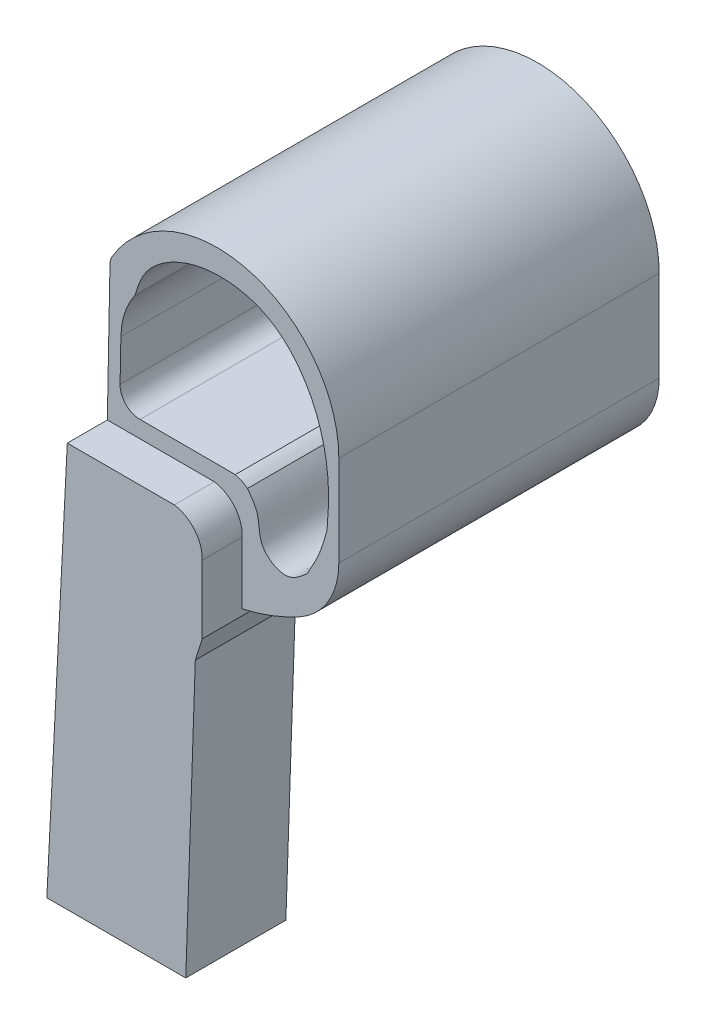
ISO-10303-21;
HEADER;
FILE_DESCRIPTION(('STEP AP214'),'2;1');
FILE_NAME('part.step','',(''),(''),'','','');
FILE_SCHEMA(('AUTOMOTIVE_DESIGN { 1 0 10303 214 1 1 1 1 }'));
ENDSEC;
DATA;
#1=APPLICATION_CONTEXT('core data for automotive mechanical design processes');
#2=APPLICATION_PROTOCOL_DEFINITION('international standard','automotive_design',2000,#1);
#3=PRODUCT_CONTEXT('',#1,'mechanical');
#4=PRODUCT('Part','Part','',(#3));
#5=PRODUCT_RELATED_PRODUCT_CATEGORY('part','',(#4));
#6=PRODUCT_DEFINITION_FORMATION('','',#4);
#7=PRODUCT_DEFINITION_CONTEXT('part definition',#1,'design');
#8=PRODUCT_DEFINITION('design','',#6,#7);
#9=PRODUCT_DEFINITION_SHAPE('','',#8);
#10=(LENGTH_UNIT() NAMED_UNIT(*) SI_UNIT(.MILLI.,.METRE.));
#11=(NAMED_UNIT(*) PLANE_ANGLE_UNIT() SI_UNIT($,.RADIAN.));
#12=(NAMED_UNIT(*) SI_UNIT($,.STERADIAN.) SOLID_ANGLE_UNIT());
#13=UNCERTAINTY_MEASURE_WITH_UNIT(LENGTH_MEASURE(1.E-05),#10,'distance_accuracy_value','');
#14=(GEOMETRIC_REPRESENTATION_CONTEXT(3) GLOBAL_UNCERTAINTY_ASSIGNED_CONTEXT((#13)) GLOBAL_UNIT_ASSIGNED_CONTEXT((#10,
#11,#12)) REPRESENTATION_CONTEXT('',''));
#15=CARTESIAN_POINT('',(0.,0.,0.));
#16=DIRECTION('',(0.,0.,1.));
#17=DIRECTION('',(1.,0.,0.));
#18=AXIS2_PLACEMENT_3D('',#15,#16,#17);
#19=CARTESIAN_POINT('',(-7.24053211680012,46.8617340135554,-65.));
#20=DIRECTION('',(0.,0.,1.));
#21=DIRECTION('',(1.,0.,0.));
#22=AXIS2_PLACEMENT_3D('',#19,#20,#21);
#23=CYLINDRICAL_SURFACE('',#22,6.73666835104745);
#24=DIRECTION('',(0.,0.,1.));
#25=VECTOR('',#24,1.);
#26=CARTESIAN_POINT('',(-8.77106708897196,53.4222342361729,-65.));
#27=LINE('',#26,#25);
#28=CARTESIAN_POINT('',(-8.77106708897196,53.4222342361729,-65.));
#29=VERTEX_POINT('',#28);
#30=CARTESIAN_POINT('',(-8.77106708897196,53.4222342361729,0.));
#31=VERTEX_POINT('',#30);
#32=EDGE_CURVE('E34',#29,#31,#27,.T.);
#33=ORIENTED_EDGE('',*,*,#32,.T.);
#34=CARTESIAN_POINT('',(-7.24053211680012,46.8617340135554,0.));
#35=DIRECTION('',(0.,0.,1.));
#36=DIRECTION('',(1.,0.,0.));
#37=AXIS2_PLACEMENT_3D('',#34,#35,#36);
#38=CIRCLE('',#37,6.73666835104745);
#39=CARTESIAN_POINT('',(-12.1966601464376,51.4245725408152,0.));
#40=VERTEX_POINT('',#39);
#41=EDGE_CURVE('E290',#31,#40,#38,.T.);
#42=ORIENTED_EDGE('',*,*,#41,.T.);
#43=DIRECTION('',(0.,0.,1.));
#44=VECTOR('',#43,1.);
#45=CARTESIAN_POINT('',(-12.1966601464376,51.4245725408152,-65.));
#46=LINE('',#45,#44);
#47=CARTESIAN_POINT('',(-12.1966601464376,51.4245725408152,-65.));
#48=VERTEX_POINT('',#47);
#49=EDGE_CURVE('E11',#48,#40,#46,.T.);
#50=ORIENTED_EDGE('',*,*,#49,.F.);
#51=CARTESIAN_POINT('',(-7.24053211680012,46.8617340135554,-65.));
#52=DIRECTION('',(0.,0.,-1.));
#53=DIRECTION('',(1.,0.,0.));
#54=AXIS2_PLACEMENT_3D('',#51,#52,#53);
#55=CIRCLE('',#54,6.73666835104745);
#56=EDGE_CURVE('E494',#48,#29,#55,.T.);
#57=ORIENTED_EDGE('',*,*,#56,.T.);
#58=EDGE_LOOP('',(#33,#42,#50,#57));
#59=FACE_BOUND('',#58,.T.);
#60=ADVANCED_FACE('F31',(#59),#23,.F.);
#61=CARTESIAN_POINT('',(-12.1966601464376,51.4245725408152,-65.));
#62=DIRECTION('',(0.,-1.,0.));
#63=DIRECTION('',(0.,0.,-1.));
#64=AXIS2_PLACEMENT_3D('',#61,#62,#63);
#65=PLANE('',#64);
#66=ORIENTED_EDGE('',*,*,#49,.T.);
#67=DIRECTION('',(-1.,0.,0.));
#68=VECTOR('',#67,1.);
#69=CARTESIAN_POINT('',(-12.1966601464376,51.4245725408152,0.));
#70=LINE('',#69,#68);
#71=CARTESIAN_POINT('',(-13.1539462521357,51.4245725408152,0.));
#72=VERTEX_POINT('',#71);
#73=EDGE_CURVE('E287',#40,#72,#70,.T.);
#74=ORIENTED_EDGE('',*,*,#73,.T.);
#75=DIRECTION('',(0.,0.,1.));
#76=VECTOR('',#75,1.);
#77=CARTESIAN_POINT('',(-13.1539462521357,51.4245725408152,-65.));
#78=LINE('',#77,#76);
#79=CARTESIAN_POINT('',(-13.1539462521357,51.4245725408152,-65.));
#80=VERTEX_POINT('',#79);
#81=EDGE_CURVE('E39',#80,#72,#78,.T.);
#82=ORIENTED_EDGE('',*,*,#81,.F.);
#83=DIRECTION('',(1.,0.,0.));
#84=VECTOR('',#83,1.);
#85=CARTESIAN_POINT('',(-12.1966601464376,51.4245725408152,-65.));
#86=LINE('',#85,#84);
#87=EDGE_CURVE('E499',#80,#48,#86,.T.);
#88=ORIENTED_EDGE('',*,*,#87,.T.);
#89=EDGE_LOOP('',(#66,#74,#82,#88));
#90=FACE_BOUND('',#89,.T.);
#91=ADVANCED_FACE('F439',(#90),#65,.T.);
#92=CARTESIAN_POINT('',(-13.1539462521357,52.4245725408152,-65.));
#93=DIRECTION('',(0.,0.,1.));
#94=DIRECTION('',(1.,0.,0.));
#95=AXIS2_PLACEMENT_3D('',#92,#93,#94);
#96=CYLINDRICAL_SURFACE('',#95,1.);
#97=ORIENTED_EDGE('',*,*,#81,.T.);
#98=CARTESIAN_POINT('',(-13.1539462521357,52.4245725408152,0.));
#99=DIRECTION('',(0.,0.,1.));
#100=DIRECTION('',(1.,0.,0.));
#101=AXIS2_PLACEMENT_3D('',#98,#99,#100);
#102=CIRCLE('',#101,1.);
#103=CARTESIAN_POINT('',(-14.1537591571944,52.4439156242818,0.));
#104=VERTEX_POINT('',#103);
#105=EDGE_CURVE('E284',#72,#104,#102,.F.);
#106=ORIENTED_EDGE('',*,*,#105,.T.);
#107=DIRECTION('',(0.,0.,1.));
#108=VECTOR('',#107,1.);
#109=CARTESIAN_POINT('',(-14.1537591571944,52.4439156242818,-65.));
#110=LINE('',#109,#108);
#111=CARTESIAN_POINT('',(-14.1537591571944,52.4439156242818,-65.));
#112=VERTEX_POINT('',#111);
#113=EDGE_CURVE('E512',#112,#104,#110,.T.);
#114=ORIENTED_EDGE('',*,*,#113,.F.);
#115=CARTESIAN_POINT('',(-13.1539462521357,52.4245725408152,-65.));
#116=DIRECTION('',(0.,0.,1.));
#117=DIRECTION('',(1.,0.,0.));
#118=AXIS2_PLACEMENT_3D('',#115,#116,#117);
#119=CIRCLE('',#118,1.);
#120=EDGE_CURVE('E502',#112,#80,#119,.T.);
#121=ORIENTED_EDGE('',*,*,#120,.T.);
#122=EDGE_LOOP('',(#97,#106,#114,#121));
#123=FACE_BOUND('',#122,.T.);
#124=ADVANCED_FACE('F442',(#123),#96,.T.);
#125=CARTESIAN_POINT('',(-13.4766245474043,87.4439156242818,-65.));
#126=DIRECTION('',(-0.999812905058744,0.0193430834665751,0.));
#127=DIRECTION('',(-0.0193430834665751,-0.999812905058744,0.));
#128=AXIS2_PLACEMENT_3D('',#125,#126,#127);
#129=PLANE('',#128);
#130=DIRECTION('',(0.0193430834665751,0.999812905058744,0.));
#131=VECTOR('',#130,1.);
#132=CARTESIAN_POINT('',(-13.4766245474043,87.4439156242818,0.));
#133=LINE('',#132,#131);
#134=CARTESIAN_POINT('',(-14.1348319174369,53.4222342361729,0.));
#135=VERTEX_POINT('',#134);
#136=EDGE_CURVE('E276',#104,#135,#133,.T.);
#137=ORIENTED_EDGE('',*,*,#136,.T.);
#138=DIRECTION('',(0.,0.,-1.));
#139=VECTOR('',#138,1.);
#140=CARTESIAN_POINT('',(-14.1348319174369,53.4222342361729,25.));
#141=LINE('',#140,#139);
#142=CARTESIAN_POINT('',(-14.1348319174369,53.4222342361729,15.));
#143=VERTEX_POINT('',#142);
#144=EDGE_CURVE('E967',#143,#135,#141,.T.);
#145=ORIENTED_EDGE('',*,*,#144,.F.);
#146=DIRECTION('',(-0.0193430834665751,-0.999812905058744,0.));
#147=VECTOR('',#146,1.);
#148=CARTESIAN_POINT('',(-13.4766245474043,87.4439156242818,15.));
#149=LINE('',#148,#147);
#150=CARTESIAN_POINT('',(-13.4766245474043,87.4439156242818,15.));
#151=VERTEX_POINT('',#150);
#152=EDGE_CURVE('E352',#151,#143,#149,.T.);
#153=ORIENTED_EDGE('',*,*,#152,.F.);
#154=DIRECTION('',(0.,0.,1.));
#155=VECTOR('',#154,1.);
#156=CARTESIAN_POINT('',(-13.4766245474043,87.4439156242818,-65.));
#157=LINE('',#156,#155);
#158=CARTESIAN_POINT('',(-13.4766245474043,87.4439156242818,-65.));
#159=VERTEX_POINT('',#158);
#160=EDGE_CURVE('E515',#159,#151,#157,.T.);
#161=ORIENTED_EDGE('',*,*,#160,.F.);
#162=DIRECTION('',(-0.0193430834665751,-0.999812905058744,0.));
#163=VECTOR('',#162,1.);
#164=CARTESIAN_POINT('',(-13.4766245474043,87.4439156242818,-65.));
#165=LINE('',#164,#163);
#166=EDGE_CURVE('E506',#159,#112,#165,.T.);
#167=ORIENTED_EDGE('',*,*,#166,.T.);
#168=ORIENTED_EDGE('',*,*,#113,.T.);
#169=EDGE_LOOP('',(#137,#145,#153,#161,#167,#168));
#170=FACE_BOUND('',#169,.T.);
#171=ADVANCED_FACE('F446',(#170),#129,.T.);
#172=CARTESIAN_POINT('',(19.549379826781,44.90179814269,-65.));
#173=DIRECTION('',(-1.,0.,0.));
#174=DIRECTION('',(0.,-1.,0.));
#175=AXIS2_PLACEMENT_3D('',#172,#173,#174);
#176=PLANE('',#175);
#177=DIRECTION('',(0.,0.,1.));
#178=VECTOR('',#177,1.);
#179=CARTESIAN_POINT('',(19.5493798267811,29.4097281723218,-65.));
#180=LINE('',#179,#178);
#181=CARTESIAN_POINT('',(19.5493798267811,29.4097281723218,-65.));
#182=VERTEX_POINT('',#181);
#183=CARTESIAN_POINT('',(19.5493798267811,29.4097281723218,0.));
#184=VERTEX_POINT('',#183);
#185=EDGE_CURVE('E525',#182,#184,#180,.T.);
#186=ORIENTED_EDGE('',*,*,#185,.T.);
#187=DIRECTION('',(0.,1.,0.));
#188=VECTOR('',#187,1.);
#189=CARTESIAN_POINT('',(19.549379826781,44.90179814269,0.));
#190=LINE('',#189,#188);
#191=CARTESIAN_POINT('',(19.549379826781,44.90179814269,0.));
#192=VERTEX_POINT('',#191);
#193=EDGE_CURVE('E573',#184,#192,#190,.T.);
#194=ORIENTED_EDGE('',*,*,#193,.T.);
#195=DIRECTION('',(0.,0.,1.));
#196=VECTOR('',#195,1.);
#197=CARTESIAN_POINT('',(19.549379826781,44.90179814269,-65.));
#198=LINE('',#197,#196);
#199=CARTESIAN_POINT('',(19.549379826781,44.90179814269,-65.));
#200=VERTEX_POINT('',#199);
#201=EDGE_CURVE('E528',#200,#192,#198,.T.);
#202=ORIENTED_EDGE('',*,*,#201,.F.);
#203=DIRECTION('',(0.,-1.,0.));
#204=VECTOR('',#203,1.);
#205=CARTESIAN_POINT('',(19.549379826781,44.90179814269,-65.));
#206=LINE('',#205,#204);
#207=EDGE_CURVE('E538',#200,#182,#206,.T.);
#208=ORIENTED_EDGE('',*,*,#207,.T.);
#209=EDGE_LOOP('',(#186,#194,#202,#208));
#210=FACE_BOUND('',#209,.T.);
#211=ADVANCED_FACE('F450',(#210),#176,.T.);
#212=CARTESIAN_POINT('',(11.3313204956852,45.2931515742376,-65.));
#213=DIRECTION('',(0.,0.,1.));
#214=DIRECTION('',(1.,0.,0.));
#215=AXIS2_PLACEMENT_3D('',#212,#213,#214);
#216=CYLINDRICAL_SURFACE('',#215,8.22737240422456);
#217=ORIENTED_EDGE('',*,*,#201,.T.);
#218=CARTESIAN_POINT('',(11.3313204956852,45.2931515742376,0.));
#219=DIRECTION('',(0.,0.,1.));
#220=DIRECTION('',(1.,0.,0.));
#221=AXIS2_PLACEMENT_3D('',#218,#219,#220);
#222=CIRCLE('',#221,8.22737240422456);
#223=CARTESIAN_POINT('',(12.5992604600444,53.4222342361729,0.));
#224=VERTEX_POINT('',#223);
#225=EDGE_CURVE('E576',#192,#224,#222,.T.);
#226=ORIENTED_EDGE('',*,*,#225,.T.);
#227=DIRECTION('',(0.,0.,1.));
#228=VECTOR('',#227,1.);
#229=CARTESIAN_POINT('',(12.5992604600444,53.4222342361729,-65.));
#230=LINE('',#229,#228);
#231=CARTESIAN_POINT('',(12.5992604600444,53.4222342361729,-35.));
#232=VERTEX_POINT('',#231);
#233=EDGE_CURVE('E498',#232,#224,#230,.T.);
#234=ORIENTED_EDGE('',*,*,#233,.F.);
#235=CARTESIAN_POINT('',(11.3313204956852,45.2931515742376,-35.));
#236=DIRECTION('',(0.,0.,1.));
#237=DIRECTION('',(1.,0.,0.));
#238=AXIS2_PLACEMENT_3D('',#235,#236,#237);
#239=CIRCLE('',#238,8.22737240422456);
#240=CARTESIAN_POINT('',(13.1589835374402,53.3149533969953,-35.));
#241=VERTEX_POINT('',#240);
#242=EDGE_CURVE('E373',#232,#241,#239,.F.);
#243=ORIENTED_EDGE('',*,*,#242,.T.);
#244=DIRECTION('',(0.,0.,1.));
#245=VECTOR('',#244,1.);
#246=CARTESIAN_POINT('',(13.1589835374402,53.3149533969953,-65.));
#247=LINE('',#246,#245);
#248=CARTESIAN_POINT('',(13.1589835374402,53.3149533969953,-62.));
#249=VERTEX_POINT('',#248);
#250=EDGE_CURVE('E370',#241,#249,#247,.F.);
#251=ORIENTED_EDGE('',*,*,#250,.T.);
#252=CARTESIAN_POINT('',(11.3313204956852,45.2931515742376,-62.));
#253=DIRECTION('',(0.,0.,-1.));
#254=DIRECTION('',(-1.,0.,0.));
#255=AXIS2_PLACEMENT_3D('',#252,#253,#254);
#256=CIRCLE('',#255,8.22737240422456);
#257=CARTESIAN_POINT('',(12.5992604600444,53.4222342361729,-62.));
#258=VERTEX_POINT('',#257);
#259=EDGE_CURVE('E393',#249,#258,#256,.F.);
#260=ORIENTED_EDGE('',*,*,#259,.T.);
#261=CARTESIAN_POINT('',(12.5992604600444,53.4222342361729,-65.));
#262=VERTEX_POINT('',#261);
#263=EDGE_CURVE('E500',#262,#258,#230,.T.);
#264=ORIENTED_EDGE('',*,*,#263,.F.);
#265=CARTESIAN_POINT('',(11.3313204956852,45.2931515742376,-65.));
#266=DIRECTION('',(0.,0.,-1.));
#267=DIRECTION('',(1.,0.,0.));
#268=AXIS2_PLACEMENT_3D('',#265,#266,#267);
#269=CIRCLE('',#268,8.22737240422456);
#270=EDGE_CURVE('E534',#262,#200,#269,.T.);
#271=ORIENTED_EDGE('',*,*,#270,.T.);
#272=EDGE_LOOP('',(#217,#226,#234,#243,#251,#260,#264,#271));
#273=FACE_BOUND('',#272,.T.);
#274=ADVANCED_FACE('F474',(#273),#216,.F.);
#275=CARTESIAN_POINT('',(-8.77106708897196,53.4222342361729,-65.));
#276=DIRECTION('',(0.,-1.,0.));
#277=DIRECTION('',(1.,0.,0.));
#278=AXIS2_PLACEMENT_3D('',#275,#276,#277);
#279=PLANE('',#278);
#280=ORIENTED_EDGE('',*,*,#233,.T.);
#281=DIRECTION('',(-1.,0.,0.));
#282=VECTOR('',#281,1.);
#283=CARTESIAN_POINT('',(-14.1348319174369,53.4222342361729,0.));
#284=LINE('',#283,#282);
#285=EDGE_CURVE('E268',#224,#31,#284,.T.);
#286=ORIENTED_EDGE('',*,*,#285,.T.);
#287=ORIENTED_EDGE('',*,*,#32,.F.);
#288=DIRECTION('',(1.,0.,0.));
#289=VECTOR('',#288,1.);
#290=CARTESIAN_POINT('',(-8.77106708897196,53.4222342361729,-65.));
#291=LINE('',#290,#289);
#292=EDGE_CURVE('E531',#29,#262,#291,.T.);
#293=ORIENTED_EDGE('',*,*,#292,.T.);
#294=ORIENTED_EDGE('',*,*,#263,.T.);
#295=DIRECTION('',(-1.,0.,0.));
#296=VECTOR('',#295,1.);
#297=CARTESIAN_POINT('',(13.1169051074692,53.4222342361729,-62.));
#298=LINE('',#297,#296);
#299=CARTESIAN_POINT('',(-5.15060468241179,53.4222342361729,-62.));
#300=VERTEX_POINT('',#299);
#301=EDGE_CURVE('E386',#258,#300,#298,.T.);
#302=ORIENTED_EDGE('',*,*,#301,.T.);
#303=DIRECTION('',(0.,0.,1.));
#304=VECTOR('',#303,1.);
#305=CARTESIAN_POINT('',(-5.15060468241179,53.4222342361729,-62.));
#306=LINE('',#305,#304);
#307=CARTESIAN_POINT('',(-5.15060468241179,53.4222342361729,-35.));
#308=VERTEX_POINT('',#307);
#309=EDGE_CURVE('E364',#300,#308,#306,.T.);
#310=ORIENTED_EDGE('',*,*,#309,.T.);
#311=DIRECTION('',(1.,0.,0.));
#312=VECTOR('',#311,1.);
#313=CARTESIAN_POINT('',(13.1169051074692,53.4222342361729,-35.));
#314=LINE('',#313,#312);
#315=EDGE_CURVE('E367',#308,#232,#314,.T.);
#316=ORIENTED_EDGE('',*,*,#315,.T.);
#317=EDGE_LOOP('',(#280,#286,#287,#293,#294,#302,#310,#316));
#318=FACE_BOUND('',#317,.T.);
#319=ADVANCED_FACE('F477',(#318),#279,.T.);
#320=CARTESIAN_POINT('',(7.54257501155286,82.4858200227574,15.));
#321=DIRECTION('',(0.,0.,1.));
#322=DIRECTION('',(1.,0.,0.));
#323=AXIS2_PLACEMENT_3D('',#320,#321,#322);
#324=PLANE('',#323);
#325=CARTESIAN_POINT('',(8.50537769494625,72.7517687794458,15.));
#326=DIRECTION('',(0.,0.,1.));
#327=DIRECTION('',(1.,0.,0.));
#328=AXIS2_PLACEMENT_3D('',#325,#326,#327);
#329=CIRCLE('',#328,19.2620809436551);
#330=CARTESIAN_POINT('',(-7.25157073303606,83.8308634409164,15.));
#331=VERTEX_POINT('',#330);
#332=CARTESIAN_POINT('',(-10.7530994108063,73.1243568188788,15.));
#333=VERTEX_POINT('',#332);
#334=EDGE_CURVE('E298',#331,#333,#329,.T.);
#335=ORIENTED_EDGE('',*,*,#334,.F.);
#336=CARTESIAN_POINT('',(40.7201929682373,56.9610477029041,15.));
#337=CARTESIAN_POINT('',(40.9265410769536,59.6668131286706,15.));
#338=CARTESIAN_POINT('',(41.4736595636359,66.8409728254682,15.));
#339=CARTESIAN_POINT('',(39.8457016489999,77.537085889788,15.));
#340=CARTESIAN_POINT('',(34.7701591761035,88.3663040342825,15.));
#341=CARTESIAN_POINT('',(26.3684538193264,96.7742638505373,15.));
#342=CARTESIAN_POINT('',(14.6973791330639,99.2738082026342,15.));
#343=CARTESIAN_POINT('',(3.4739000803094,97.2386389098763,15.));
#344=CARTESIAN_POINT('',(-4.8338188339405,91.4199405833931,15.));
#345=CARTESIAN_POINT('',(-6.64345627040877,85.7396728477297,15.));
#346=CARTESIAN_POINT('',(-7.25157073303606,83.8308634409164,15.));
#347=B_SPLINE_CURVE_WITH_KNOTS('',3,(#336,#337,#338,#339,#340,#341,#342,#343,#344,#345,#346),
.UNSPECIFIED.,.F.,.F.,(4,1,1,1,1,1,1,1,4),(0.00471549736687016,0.101589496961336,
0.261570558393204,0.384074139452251,0.525025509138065,0.66874261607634,0.789849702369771,
0.929380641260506,1.),.UNSPECIFIED.);
#348=CARTESIAN_POINT('',(40.7201929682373,56.9610477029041,15.));
#349=VERTEX_POINT('',#348);
#350=EDGE_CURVE('E293',#349,#331,#347,.T.);
#351=ORIENTED_EDGE('',*,*,#350,.F.);
#352=CARTESIAN_POINT('',(35.7706433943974,45.1315321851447,15.));
#353=CARTESIAN_POINT('',(36.8818577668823,47.0918553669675,15.));
#354=CARTESIAN_POINT('',(39.0058005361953,50.8387599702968,15.));
#355=CARTESIAN_POINT('',(40.1666717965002,54.9843614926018,15.));
#356=CARTESIAN_POINT('',(40.7201929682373,56.9610477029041,15.));
#357=B_SPLINE_CURVE_WITH_KNOTS('',3,(#352,#353,#354,#355,#356),.UNSPECIFIED.,.F.,.F.,(4,1,4),
(0.,0.52318470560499,1.),.UNSPECIFIED.);
#358=CARTESIAN_POINT('',(35.7706433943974,45.1315321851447,15.));
#359=VERTEX_POINT('',#358);
#360=EDGE_CURVE('E326',#359,#349,#357,.T.);
#361=ORIENTED_EDGE('',*,*,#360,.F.);
#362=CARTESIAN_POINT('',(20.8836999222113,56.1323212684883,15.));
#363=CARTESIAN_POINT('',(21.8730411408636,54.7662342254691,15.));
#364=CARTESIAN_POINT('',(24.130901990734,51.6485692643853,15.));
#365=CARTESIAN_POINT('',(23.2771179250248,45.0711896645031,15.));
#366=CARTESIAN_POINT('',(30.548419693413,40.5490511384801,15.));
#367=CARTESIAN_POINT('',(34.0974238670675,43.6632885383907,15.));
#368=CARTESIAN_POINT('',(35.7706433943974,45.1315321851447,15.));
#369=B_SPLINE_CURVE_WITH_KNOTS('',3,(#362,#363,#364,#365,#366,#367,#368),.UNSPECIFIED.,.F.,.F.,
(4,1,1,1,4),(0.,0.20329843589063,0.46396487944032,0.747279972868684,1.),.UNSPECIFIED.);
#370=CARTESIAN_POINT('',(20.8836999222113,56.1323212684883,15.));
#371=VERTEX_POINT('',#370);
#372=EDGE_CURVE('E318',#371,#359,#369,.T.);
#373=ORIENTED_EDGE('',*,*,#372,.F.);
#374=CARTESIAN_POINT('',(17.8077625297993,57.5800551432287,15.));
#375=CARTESIAN_POINT('',(18.2228956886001,57.465583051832,15.));
#376=CARTESIAN_POINT('',(19.3264743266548,57.1612735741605,15.));
#377=CARTESIAN_POINT('',(20.2854574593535,56.5276159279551,15.));
#378=CARTESIAN_POINT('',(20.8836999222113,56.1323212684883,15.));
#379=B_SPLINE_CURVE_WITH_KNOTS('',3,(#374,#375,#376,#377,#378),.UNSPECIFIED.,.F.,.F.,(4,1,4),
(0.,0.37616998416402,1.),.UNSPECIFIED.);
#380=CARTESIAN_POINT('',(17.8077625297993,57.5800551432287,15.));
#381=VERTEX_POINT('',#380);
#382=EDGE_CURVE('E313',#381,#371,#379,.T.);
#383=ORIENTED_EDGE('',*,*,#382,.F.);
#384=DIRECTION('',(0.999998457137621,-0.0017566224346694,0.));
#385=VECTOR('',#384,1.);
#386=CARTESIAN_POINT('',(-5.96413661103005,57.6218134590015,15.));
#387=LINE('',#386,#385);
#388=CARTESIAN_POINT('',(-5.96413661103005,57.6218134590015,15.));
#389=VERTEX_POINT('',#388);
#390=EDGE_CURVE('E310',#389,#381,#387,.T.);
#391=ORIENTED_EDGE('',*,*,#390,.F.);
#392=CARTESIAN_POINT('',(-5.95535349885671,62.6218057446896,15.));
#393=DIRECTION('',(0.,0.,1.));
#394=DIRECTION('',(1.,0.,0.));
#395=AXIS2_PLACEMENT_3D('',#392,#393,#394);
#396=CIRCLE('',#395,4.99999999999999);
#397=CARTESIAN_POINT('',(-10.9544180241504,62.7185211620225,15.));
#398=VERTEX_POINT('',#397);
#399=EDGE_CURVE('E307',#398,#389,#396,.T.);
#400=ORIENTED_EDGE('',*,*,#399,.F.);
#401=DIRECTION('',(-0.0193430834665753,-0.999812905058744,0.));
#402=VECTOR('',#401,1.);
#403=CARTESIAN_POINT('',(-10.7530994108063,73.1243568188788,15.));
#404=LINE('',#403,#402);
#405=EDGE_CURVE('E304',#333,#398,#404,.T.);
#406=ORIENTED_EDGE('',*,*,#405,.F.);
#407=EDGE_LOOP('',(#335,#351,#361,#373,#383,#391,#400,#406));
#408=FACE_BOUND('',#407,.T.);
#409=ORIENTED_EDGE('',*,*,#152,.T.);
#410=DIRECTION('',(1.,0.,0.));
#411=VECTOR('',#410,1.);
#412=CARTESIAN_POINT('',(-8.77106708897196,53.4222342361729,15.));
#413=LINE('',#412,#411);
#414=CARTESIAN_POINT('',(12.5992604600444,53.4222342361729,15.));
#415=VERTEX_POINT('',#414);
#416=EDGE_CURVE('E355',#143,#415,#413,.T.);
#417=ORIENTED_EDGE('',*,*,#416,.T.);
#418=CARTESIAN_POINT('',(11.3313204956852,45.2931515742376,15.));
#419=DIRECTION('',(0.,0.,-1.));
#420=DIRECTION('',(1.,0.,0.));
#421=AXIS2_PLACEMENT_3D('',#418,#419,#420);
#422=CIRCLE('',#421,8.22737240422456);
#423=CARTESIAN_POINT('',(19.549379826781,44.90179814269,15.));
#424=VERTEX_POINT('',#423);
#425=EDGE_CURVE('E358',#415,#424,#422,.T.);
#426=ORIENTED_EDGE('',*,*,#425,.T.);
#427=DIRECTION('',(0.,-1.,0.));
#428=VECTOR('',#427,1.);
#429=CARTESIAN_POINT('',(19.549379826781,44.90179814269,15.));
#430=LINE('',#429,#428);
#431=CARTESIAN_POINT('',(19.5493798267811,29.4097281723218,15.));
#432=VERTEX_POINT('',#431);
#433=EDGE_CURVE('E361',#424,#432,#430,.T.);
#434=ORIENTED_EDGE('',*,*,#433,.T.);
#435=CARTESIAN_POINT('',(7.54257501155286,82.4858200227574,15.));
#436=DIRECTION('',(0.,0.,1.));
#437=DIRECTION('',(1.,0.,0.));
#438=AXIS2_PLACEMENT_3D('',#435,#436,#437);
#439=CIRCLE('',#438,54.4172296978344);
#440=CARTESIAN_POINT('',(34.0094960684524,34.9386121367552,15.));
#441=VERTEX_POINT('',#440);
#442=EDGE_CURVE('E334',#432,#441,#439,.T.);
#443=ORIENTED_EDGE('',*,*,#442,.T.);
#444=CARTESIAN_POINT('',(24.859243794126,51.3768274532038,15.));
#445=DIRECTION('',(0.,0.,1.));
#446=DIRECTION('',(1.,0.,0.));
#447=AXIS2_PLACEMENT_3D('',#444,#445,#446);
#448=CIRCLE('',#447,18.8133473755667);
#449=CARTESIAN_POINT('',(43.6725911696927,51.3768274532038,15.));
#450=VERTEX_POINT('',#449);
#451=EDGE_CURVE('E340',#441,#450,#448,.T.);
#452=ORIENTED_EDGE('',*,*,#451,.T.);
#453=DIRECTION('',(0.,1.,0.));
#454=VECTOR('',#453,1.);
#455=CARTESIAN_POINT('',(43.6725911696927,51.3768274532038,15.));
#456=LINE('',#455,#454);
#457=CARTESIAN_POINT('',(43.6725911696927,74.0471432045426,15.));
#458=VERTEX_POINT('',#457);
#459=EDGE_CURVE('E343',#450,#458,#456,.T.);
#460=ORIENTED_EDGE('',*,*,#459,.T.);
#461=CARTESIAN_POINT('',(13.2928629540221,74.0471432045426,15.));
#462=DIRECTION('',(0.,0.,1.));
#463=DIRECTION('',(1.,0.,0.));
#464=AXIS2_PLACEMENT_3D('',#461,#462,#463);
#465=CIRCLE('',#464,30.3797282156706);
#466=CARTESIAN_POINT('',(-12.9300598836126,89.3861850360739,15.));
#467=VERTEX_POINT('',#466);
#468=EDGE_CURVE('E346',#458,#467,#465,.T.);
#469=ORIENTED_EDGE('',*,*,#468,.T.);
#470=CARTESIAN_POINT('',(-9.47737292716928,87.3665432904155,15.));
#471=DIRECTION('',(0.,0.,1.));
#472=DIRECTION('',(1.,0.,0.));
#473=AXIS2_PLACEMENT_3D('',#470,#471,#472);
#474=CIRCLE('',#473,4.);
#475=EDGE_CURVE('E349',#467,#151,#474,.T.);
#476=ORIENTED_EDGE('',*,*,#475,.T.);
#477=EDGE_LOOP('',(#409,#417,#426,#434,#443,#452,#460,#469,#476));
#478=FACE_BOUND('',#477,.T.);
#479=ADVANCED_FACE('F456',(#408,#478),#324,.T.);
#480=CARTESIAN_POINT('',(-9.47737292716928,87.3665432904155,-65.));
#481=DIRECTION('',(0.,0.,1.));
#482=DIRECTION('',(1.,0.,0.));
#483=AXIS2_PLACEMENT_3D('',#480,#481,#482);
#484=CYLINDRICAL_SURFACE('',#483,3.99999999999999);
#485=ORIENTED_EDGE('',*,*,#160,.T.);
#486=ORIENTED_EDGE('',*,*,#475,.F.);
#487=DIRECTION('',(0.,0.,1.));
#488=VECTOR('',#487,1.);
#489=CARTESIAN_POINT('',(-12.9300598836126,89.3861850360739,-65.));
#490=LINE('',#489,#488);
#491=CARTESIAN_POINT('',(-12.9300598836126,89.3861850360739,-65.));
#492=VERTEX_POINT('',#491);
#493=EDGE_CURVE('E517',#492,#467,#490,.T.);
#494=ORIENTED_EDGE('',*,*,#493,.F.);
#495=CARTESIAN_POINT('',(-9.47737292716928,87.3665432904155,-65.));
#496=DIRECTION('',(0.,0.,1.));
#497=DIRECTION('',(1.,0.,0.));
#498=AXIS2_PLACEMENT_3D('',#495,#496,#497);
#499=CIRCLE('',#498,3.99999999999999);
#500=EDGE_CURVE('E556',#492,#159,#499,.T.);
#501=ORIENTED_EDGE('',*,*,#500,.T.);
#502=EDGE_LOOP('',(#485,#486,#494,#501));
#503=FACE_BOUND('',#502,.T.);
#504=ADVANCED_FACE('F452',(#503),#484,.T.);
#505=CARTESIAN_POINT('',(13.2928629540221,74.0471432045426,-65.));
#506=DIRECTION('',(0.,0.,1.));
#507=DIRECTION('',(1.,0.,0.));
#508=AXIS2_PLACEMENT_3D('',#505,#506,#507);
#509=CYLINDRICAL_SURFACE('',#508,30.3797282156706);
#510=ORIENTED_EDGE('',*,*,#493,.T.);
#511=ORIENTED_EDGE('',*,*,#468,.F.);
#512=DIRECTION('',(0.,0.,1.));
#513=VECTOR('',#512,1.);
#514=CARTESIAN_POINT('',(43.6725911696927,74.0471432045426,-65.));
#515=LINE('',#514,#513);
#516=CARTESIAN_POINT('',(43.6725911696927,74.0471432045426,-65.));
#517=VERTEX_POINT('',#516);
#518=EDGE_CURVE('E519',#517,#458,#515,.T.);
#519=ORIENTED_EDGE('',*,*,#518,.F.);
#520=CARTESIAN_POINT('',(13.2928629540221,74.0471432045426,-65.));
#521=DIRECTION('',(0.,0.,1.));
#522=DIRECTION('',(1.,0.,0.));
#523=AXIS2_PLACEMENT_3D('',#520,#521,#522);
#524=CIRCLE('',#523,30.3797282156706);
#525=EDGE_CURVE('E553',#517,#492,#524,.T.);
#526=ORIENTED_EDGE('',*,*,#525,.T.);
#527=EDGE_LOOP('',(#510,#511,#519,#526));
#528=FACE_BOUND('',#527,.T.);
#529=ADVANCED_FACE('F455',(#528),#509,.T.);
#530=CARTESIAN_POINT('',(43.6725911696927,51.3768274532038,-65.));
#531=DIRECTION('',(1.,0.,0.));
#532=DIRECTION('',(0.,1.,0.));
#533=AXIS2_PLACEMENT_3D('',#530,#531,#532);
#534=PLANE('',#533);
#535=ORIENTED_EDGE('',*,*,#518,.T.);
#536=ORIENTED_EDGE('',*,*,#459,.F.);
#537=DIRECTION('',(0.,0.,1.));
#538=VECTOR('',#537,1.);
#539=CARTESIAN_POINT('',(43.6725911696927,51.3768274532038,-65.));
#540=LINE('',#539,#538);
#541=CARTESIAN_POINT('',(43.6725911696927,51.3768274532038,-65.));
#542=VERTEX_POINT('',#541);
#543=EDGE_CURVE('E521',#542,#450,#540,.T.);
#544=ORIENTED_EDGE('',*,*,#543,.F.);
#545=DIRECTION('',(0.,1.,0.));
#546=VECTOR('',#545,1.);
#547=CARTESIAN_POINT('',(43.6725911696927,51.3768274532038,-65.));
#548=LINE('',#547,#546);
#549=EDGE_CURVE('E550',#542,#517,#548,.T.);
#550=ORIENTED_EDGE('',*,*,#549,.T.);
#551=EDGE_LOOP('',(#535,#536,#544,#550));
#552=FACE_BOUND('',#551,.T.);
#553=ADVANCED_FACE('F460',(#552),#534,.T.);
#554=CARTESIAN_POINT('',(24.859243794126,51.3768274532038,-65.));
#555=DIRECTION('',(0.,0.,1.));
#556=DIRECTION('',(1.,0.,0.));
#557=AXIS2_PLACEMENT_3D('',#554,#555,#556);
#558=CYLINDRICAL_SURFACE('',#557,18.8133473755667);
#559=ORIENTED_EDGE('',*,*,#543,.T.);
#560=ORIENTED_EDGE('',*,*,#451,.F.);
#561=DIRECTION('',(0.,0.,1.));
#562=VECTOR('',#561,1.);
#563=CARTESIAN_POINT('',(34.0094960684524,34.9386121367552,-65.));
#564=LINE('',#563,#562);
#565=CARTESIAN_POINT('',(34.0094960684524,34.9386121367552,-65.));
#566=VERTEX_POINT('',#565);
#567=EDGE_CURVE('E523',#566,#441,#564,.T.);
#568=ORIENTED_EDGE('',*,*,#567,.F.);
#569=CARTESIAN_POINT('',(24.859243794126,51.3768274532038,-65.));
#570=DIRECTION('',(0.,0.,1.));
#571=DIRECTION('',(-1.,0.,0.));
#572=AXIS2_PLACEMENT_3D('',#569,#570,#571);
#573=CIRCLE('',#572,18.8133473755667);
#574=EDGE_CURVE('E547',#566,#542,#573,.T.);
#575=ORIENTED_EDGE('',*,*,#574,.T.);
#576=EDGE_LOOP('',(#559,#560,#568,#575));
#577=FACE_BOUND('',#576,.T.);
#578=ADVANCED_FACE('F464',(#577),#558,.T.);
#579=CARTESIAN_POINT('',(7.54257501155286,82.4858200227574,-65.));
#580=DIRECTION('',(0.,0.,1.));
#581=DIRECTION('',(1.,0.,0.));
#582=AXIS2_PLACEMENT_3D('',#579,#580,#581);
#583=CYLINDRICAL_SURFACE('',#582,54.4172296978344);
#584=ORIENTED_EDGE('',*,*,#567,.T.);
#585=ORIENTED_EDGE('',*,*,#442,.F.);
#586=DIRECTION('',(0.,0.,1.));
#587=VECTOR('',#586,1.);
#588=CARTESIAN_POINT('',(19.5493798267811,29.4097281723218,-65.));
#589=LINE('',#588,#587);
#590=EDGE_CURVE('E273',#432,#184,#589,.F.);
#591=ORIENTED_EDGE('',*,*,#590,.T.);
#592=ORIENTED_EDGE('',*,*,#185,.F.);
#593=CARTESIAN_POINT('',(7.54257501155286,82.4858200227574,-65.));
#594=DIRECTION('',(0.,0.,1.));
#595=DIRECTION('',(-1.,0.,0.));
#596=AXIS2_PLACEMENT_3D('',#593,#594,#595);
#597=CIRCLE('',#596,54.4172296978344);
#598=EDGE_CURVE('E540',#182,#566,#597,.T.);
#599=ORIENTED_EDGE('',*,*,#598,.T.);
#600=EDGE_LOOP('',(#584,#585,#591,#592,#599));
#601=FACE_BOUND('',#600,.T.);
#602=ADVANCED_FACE('F437',(#601),#583,.T.);
#603=CARTESIAN_POINT('',(-7.24053211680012,46.8617340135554,-65.));
#604=DIRECTION('',(0.,0.,1.));
#605=DIRECTION('',(1.,0.,0.));
#606=AXIS2_PLACEMENT_3D('',#603,#604,#605);
#607=PLANE('',#606);
#608=ORIENTED_EDGE('',*,*,#56,.F.);
#609=ORIENTED_EDGE('',*,*,#87,.F.);
#610=ORIENTED_EDGE('',*,*,#120,.F.);
#611=ORIENTED_EDGE('',*,*,#166,.F.);
#612=ORIENTED_EDGE('',*,*,#500,.F.);
#613=ORIENTED_EDGE('',*,*,#525,.F.);
#614=ORIENTED_EDGE('',*,*,#549,.F.);
#615=ORIENTED_EDGE('',*,*,#574,.F.);
#616=ORIENTED_EDGE('',*,*,#598,.F.);
#617=ORIENTED_EDGE('',*,*,#207,.F.);
#618=ORIENTED_EDGE('',*,*,#270,.F.);
#619=ORIENTED_EDGE('',*,*,#292,.F.);
#620=EDGE_LOOP('',(#608,#609,#610,#611,#612,#613,#614,#615,#616,#617,#618,#619));
#621=FACE_BOUND('',#620,.T.);
#622=ADVANCED_FACE('F433',(#621),#607,.F.);
#623=CARTESIAN_POINT('',(-5.95535349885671,62.6218057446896,-62.));
#624=DIRECTION('',(0.,0.,1.));
#625=DIRECTION('',(1.,0.,0.));
#626=AXIS2_PLACEMENT_3D('',#623,#624,#625);
#627=CYLINDRICAL_SURFACE('',#626,4.99999999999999);
#628=DIRECTION('',(0.,0.,1.));
#629=VECTOR('',#628,1.);
#630=CARTESIAN_POINT('',(-10.9544180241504,62.7185211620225,-62.));
#631=LINE('',#630,#629);
#632=CARTESIAN_POINT('',(-10.9544180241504,62.7185211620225,-62.));
#633=VERTEX_POINT('',#632);
#634=EDGE_CURVE('E949',#633,#398,#631,.T.);
#635=ORIENTED_EDGE('',*,*,#634,.T.);
#636=ORIENTED_EDGE('',*,*,#399,.T.);
#637=DIRECTION('',(0.,0.,1.));
#638=VECTOR('',#637,1.);
#639=CARTESIAN_POINT('',(-5.96413661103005,57.6218134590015,-62.));
#640=LINE('',#639,#638);
#641=CARTESIAN_POINT('',(-5.96413661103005,57.6218134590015,-62.));
#642=VERTEX_POINT('',#641);
#643=EDGE_CURVE('E597',#642,#389,#640,.T.);
#644=ORIENTED_EDGE('',*,*,#643,.F.);
#645=CARTESIAN_POINT('',(-5.95535349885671,62.6218057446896,-62.));
#646=DIRECTION('',(0.,0.,1.));
#647=DIRECTION('',(1.,0.,0.));
#648=AXIS2_PLACEMENT_3D('',#645,#646,#647);
#649=CIRCLE('',#648,4.99999999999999);
#650=EDGE_CURVE('E396',#633,#642,#649,.T.);
#651=ORIENTED_EDGE('',*,*,#650,.F.);
#652=EDGE_LOOP('',(#635,#636,#644,#651));
#653=FACE_BOUND('',#652,.T.);
#654=ADVANCED_FACE('F429',(#653),#627,.F.);
#655=CARTESIAN_POINT('',(-10.7530994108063,73.1243568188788,-62.));
#656=DIRECTION('',(-0.999812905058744,0.0193430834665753,0.));
#657=DIRECTION('',(-0.0193430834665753,-0.999812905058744,0.));
#658=AXIS2_PLACEMENT_3D('',#655,#656,#657);
#659=PLANE('',#658);
#660=DIRECTION('',(0.,0.,1.));
#661=VECTOR('',#660,1.);
#662=CARTESIAN_POINT('',(-10.7530994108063,73.1243568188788,-62.));
#663=LINE('',#662,#661);
#664=CARTESIAN_POINT('',(-10.7530994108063,73.1243568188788,-62.));
#665=VERTEX_POINT('',#664);
#666=EDGE_CURVE('E950',#665,#333,#663,.T.);
#667=ORIENTED_EDGE('',*,*,#666,.T.);
#668=ORIENTED_EDGE('',*,*,#405,.T.);
#669=ORIENTED_EDGE('',*,*,#634,.F.);
#670=DIRECTION('',(-0.0193430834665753,-0.999812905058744,0.));
#671=VECTOR('',#670,1.);
#672=CARTESIAN_POINT('',(-10.7530994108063,73.1243568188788,-62.));
#673=LINE('',#672,#671);
#674=EDGE_CURVE('E948',#665,#633,#673,.T.);
#675=ORIENTED_EDGE('',*,*,#674,.F.);
#676=EDGE_LOOP('',(#667,#668,#669,#675));
#677=FACE_BOUND('',#676,.T.);
#678=ADVANCED_FACE('F432',(#677),#659,.F.);
#679=CARTESIAN_POINT('',(8.50537769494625,72.7517687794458,-62.));
#680=DIRECTION('',(0.,0.,1.));
#681=DIRECTION('',(1.,0.,0.));
#682=AXIS2_PLACEMENT_3D('',#679,#680,#681);
#683=CYLINDRICAL_SURFACE('',#682,19.2620809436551);
#684=DIRECTION('',(0.,0.,1.));
#685=VECTOR('',#684,1.);
#686=CARTESIAN_POINT('',(-7.25157073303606,83.8308634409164,-62.));
#687=LINE('',#686,#685);
#688=CARTESIAN_POINT('',(-7.25157073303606,83.8308634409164,-62.));
#689=VERTEX_POINT('',#688);
#690=EDGE_CURVE('E944',#689,#331,#687,.T.);
#691=ORIENTED_EDGE('',*,*,#690,.T.);
#692=ORIENTED_EDGE('',*,*,#334,.T.);
#693=ORIENTED_EDGE('',*,*,#666,.F.);
#694=CARTESIAN_POINT('',(8.50537769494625,72.7517687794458,-62.));
#695=DIRECTION('',(0.,0.,1.));
#696=DIRECTION('',(-1.,0.,0.));
#697=AXIS2_PLACEMENT_3D('',#694,#695,#696);
#698=CIRCLE('',#697,19.2620809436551);
#699=EDGE_CURVE('E607',#689,#665,#698,.T.);
#700=ORIENTED_EDGE('',*,*,#699,.F.);
#701=EDGE_LOOP('',(#691,#692,#693,#700));
#702=FACE_BOUND('',#701,.T.);
#703=ADVANCED_FACE('F626',(#702),#683,.F.);
#704=CARTESIAN_POINT('',(40.7201929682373,56.9610477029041,-62.));
#705=CARTESIAN_POINT('',(40.9265410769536,59.6668131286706,-62.));
#706=CARTESIAN_POINT('',(41.4736595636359,66.8409728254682,-62.));
#707=CARTESIAN_POINT('',(39.8457016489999,77.537085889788,-62.));
#708=CARTESIAN_POINT('',(34.7701591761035,88.3663040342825,-62.));
#709=CARTESIAN_POINT('',(26.3684538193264,96.7742638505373,-62.));
#710=CARTESIAN_POINT('',(14.6973791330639,99.2738082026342,-62.));
#711=CARTESIAN_POINT('',(3.4739000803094,97.2386389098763,-62.));
#712=CARTESIAN_POINT('',(-4.8338188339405,91.4199405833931,-62.));
#713=CARTESIAN_POINT('',(-6.64345627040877,85.7396728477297,-62.));
#714=CARTESIAN_POINT('',(-7.25157073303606,83.8308634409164,-62.));
#715=B_SPLINE_CURVE_WITH_KNOTS('',3,(#704,#705,#706,#707,#708,#709,#710,#711,#712,#713,#714),
.UNSPECIFIED.,.F.,.F.,(4,1,1,1,1,1,1,1,4),(0.00471549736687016,0.101589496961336,
0.261570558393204,0.384074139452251,0.525025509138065,0.66874261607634,0.789849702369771,
0.929380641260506,1.),.UNSPECIFIED.);
#716=DIRECTION('',(0.,0.,1.));
#717=VECTOR('',#716,1.);
#718=SURFACE_OF_LINEAR_EXTRUSION('',#715,#717);
#719=DIRECTION('',(0.,0.,1.));
#720=VECTOR('',#719,1.);
#721=CARTESIAN_POINT('',(40.7201929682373,56.9610477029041,-62.));
#722=LINE('',#721,#720);
#723=CARTESIAN_POINT('',(40.7201929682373,56.9610477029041,-62.));
#724=VERTEX_POINT('',#723);
#725=EDGE_CURVE('E941',#724,#349,#722,.T.);
#726=ORIENTED_EDGE('',*,*,#725,.T.);
#727=ORIENTED_EDGE('',*,*,#350,.T.);
#728=ORIENTED_EDGE('',*,*,#690,.F.);
#729=EDGE_CURVE('E606',#724,#689,#715,.T.);
#730=ORIENTED_EDGE('',*,*,#729,.F.);
#731=EDGE_LOOP('',(#726,#727,#728,#730));
#732=FACE_BOUND('',#731,.T.);
#733=ADVANCED_FACE('F622',(#732),#718,.F.);
#734=CARTESIAN_POINT('',(35.7706433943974,45.1315321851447,-62.));
#735=CARTESIAN_POINT('',(36.8818577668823,47.0918553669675,-62.));
#736=CARTESIAN_POINT('',(39.0058005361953,50.8387599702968,-62.));
#737=CARTESIAN_POINT('',(40.1666717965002,54.9843614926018,-62.));
#738=CARTESIAN_POINT('',(40.7201929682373,56.9610477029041,-62.));
#739=B_SPLINE_CURVE_WITH_KNOTS('',3,(#734,#735,#736,#737,#738),.UNSPECIFIED.,.F.,.F.,(4,1,4),
(0.,0.52318470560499,1.),.UNSPECIFIED.);
#740=DIRECTION('',(0.,0.,1.));
#741=VECTOR('',#740,1.);
#742=SURFACE_OF_LINEAR_EXTRUSION('',#739,#741);
#743=DIRECTION('',(0.,0.,1.));
#744=VECTOR('',#743,1.);
#745=CARTESIAN_POINT('',(35.7706433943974,45.1315321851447,-62.));
#746=LINE('',#745,#744);
#747=CARTESIAN_POINT('',(35.7706433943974,45.1315321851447,-62.));
#748=VERTEX_POINT('',#747);
#749=EDGE_CURVE('E937',#748,#359,#746,.T.);
#750=ORIENTED_EDGE('',*,*,#749,.T.);
#751=ORIENTED_EDGE('',*,*,#360,.T.);
#752=ORIENTED_EDGE('',*,*,#725,.F.);
#753=EDGE_CURVE('E604',#748,#724,#739,.T.);
#754=ORIENTED_EDGE('',*,*,#753,.F.);
#755=EDGE_LOOP('',(#750,#751,#752,#754));
#756=FACE_BOUND('',#755,.T.);
#757=ADVANCED_FACE('F619',(#756),#742,.F.);
#758=CARTESIAN_POINT('',(20.8836999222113,56.1323212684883,-62.));
#759=CARTESIAN_POINT('',(21.8730411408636,54.7662342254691,-62.));
#760=CARTESIAN_POINT('',(24.130901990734,51.6485692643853,-62.));
#761=CARTESIAN_POINT('',(23.2771179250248,45.0711896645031,-62.));
#762=CARTESIAN_POINT('',(30.548419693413,40.5490511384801,-62.));
#763=CARTESIAN_POINT('',(34.0974238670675,43.6632885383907,-62.));
#764=CARTESIAN_POINT('',(35.7706433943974,45.1315321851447,-62.));
#765=B_SPLINE_CURVE_WITH_KNOTS('',3,(#758,#759,#760,#761,#762,#763,#764),.UNSPECIFIED.,.F.,.F.,
(4,1,1,1,4),(0.,0.20329843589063,0.46396487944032,0.747279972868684,1.),.UNSPECIFIED.);
#766=DIRECTION('',(0.,0.,1.));
#767=VECTOR('',#766,1.);
#768=SURFACE_OF_LINEAR_EXTRUSION('',#765,#767);
#769=DIRECTION('',(0.,0.,1.));
#770=VECTOR('',#769,1.);
#771=CARTESIAN_POINT('',(20.8836999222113,56.1323212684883,-62.));
#772=LINE('',#771,#770);
#773=CARTESIAN_POINT('',(20.8836999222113,56.1323212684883,-62.));
#774=VERTEX_POINT('',#773);
#775=EDGE_CURVE('E596',#774,#371,#772,.T.);
#776=ORIENTED_EDGE('',*,*,#775,.T.);
#777=ORIENTED_EDGE('',*,*,#372,.T.);
#778=ORIENTED_EDGE('',*,*,#749,.F.);
#779=EDGE_CURVE('E408',#774,#748,#765,.T.);
#780=ORIENTED_EDGE('',*,*,#779,.F.);
#781=EDGE_LOOP('',(#776,#777,#778,#780));
#782=FACE_BOUND('',#781,.T.);
#783=ADVANCED_FACE('F422',(#782),#768,.F.);
#784=CARTESIAN_POINT('',(17.8077625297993,57.5800551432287,-62.));
#785=CARTESIAN_POINT('',(18.2228956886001,57.465583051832,-62.));
#786=CARTESIAN_POINT('',(19.3264743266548,57.1612735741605,-62.));
#787=CARTESIAN_POINT('',(20.2854574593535,56.5276159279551,-62.));
#788=CARTESIAN_POINT('',(20.8836999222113,56.1323212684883,-62.));
#789=B_SPLINE_CURVE_WITH_KNOTS('',3,(#784,#785,#786,#787,#788),.UNSPECIFIED.,.F.,.F.,(4,1,4),
(0.,0.37616998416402,1.),.UNSPECIFIED.);
#790=DIRECTION('',(0.,0.,1.));
#791=VECTOR('',#790,1.);
#792=SURFACE_OF_LINEAR_EXTRUSION('',#789,#791);
#793=DIRECTION('',(0.,0.,1.));
#794=VECTOR('',#793,1.);
#795=CARTESIAN_POINT('',(17.8077625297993,57.5800551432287,-62.));
#796=LINE('',#795,#794);
#797=CARTESIAN_POINT('',(17.8077625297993,57.5800551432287,-62.));
#798=VERTEX_POINT('',#797);
#799=EDGE_CURVE('E592',#798,#381,#796,.T.);
#800=ORIENTED_EDGE('',*,*,#799,.T.);
#801=ORIENTED_EDGE('',*,*,#382,.T.);
#802=ORIENTED_EDGE('',*,*,#775,.F.);
#803=EDGE_CURVE('E402',#798,#774,#789,.T.);
#804=ORIENTED_EDGE('',*,*,#803,.F.);
#805=EDGE_LOOP('',(#800,#801,#802,#804));
#806=FACE_BOUND('',#805,.T.);
#807=ADVANCED_FACE('F417',(#806),#792,.F.);
#808=CARTESIAN_POINT('',(-5.96413661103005,57.6218134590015,-62.));
#809=DIRECTION('',(-0.0017566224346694,-0.999998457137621,0.));
#810=DIRECTION('',(0.999998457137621,-0.0017566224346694,0.));
#811=AXIS2_PLACEMENT_3D('',#808,#809,#810);
#812=PLANE('',#811);
#813=DIRECTION('',(0.999998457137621,-0.0017566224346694,0.));
#814=VECTOR('',#813,1.);
#815=CARTESIAN_POINT('',(-5.96413661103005,57.6218134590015,-62.));
#816=LINE('',#815,#814);
#817=CARTESIAN_POINT('',(13.1664900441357,57.5882081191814,-62.));
#818=VERTEX_POINT('',#817);
#819=EDGE_CURVE('E399',#818,#798,#816,.T.);
#820=ORIENTED_EDGE('',*,*,#819,.F.);
#821=DIRECTION('',(0.,0.,-1.));
#822=VECTOR('',#821,1.);
#823=CARTESIAN_POINT('',(13.1664900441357,57.5882081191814,-62.));
#824=LINE('',#823,#822);
#825=CARTESIAN_POINT('',(13.1664900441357,57.5882081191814,-35.));
#826=VERTEX_POINT('',#825);
#827=EDGE_CURVE('E55',#826,#818,#824,.T.);
#828=ORIENTED_EDGE('',*,*,#827,.F.);
#829=DIRECTION('',(0.999998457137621,-0.0017566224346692,0.));
#830=VECTOR('',#829,1.);
#831=CARTESIAN_POINT('',(13.1664900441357,57.5882081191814,-35.));
#832=LINE('',#831,#830);
#833=CARTESIAN_POINT('',(-5.14323012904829,57.6203714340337,-35.));
#834=VERTEX_POINT('',#833);
#835=EDGE_CURVE('E380',#834,#826,#832,.T.);
#836=ORIENTED_EDGE('',*,*,#835,.F.);
#837=DIRECTION('',(0.,0.,1.));
#838=VECTOR('',#837,1.);
#839=CARTESIAN_POINT('',(-5.14323012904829,57.6203714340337,-62.));
#840=LINE('',#839,#838);
#841=CARTESIAN_POINT('',(-5.14323012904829,57.6203714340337,-62.));
#842=VERTEX_POINT('',#841);
#843=EDGE_CURVE('E377',#842,#834,#840,.T.);
#844=ORIENTED_EDGE('',*,*,#843,.F.);
#845=EDGE_CURVE('E400',#642,#842,#816,.T.);
#846=ORIENTED_EDGE('',*,*,#845,.F.);
#847=ORIENTED_EDGE('',*,*,#643,.T.);
#848=ORIENTED_EDGE('',*,*,#390,.T.);
#849=ORIENTED_EDGE('',*,*,#799,.F.);
#850=EDGE_LOOP('',(#820,#828,#836,#844,#846,#847,#848,#849));
#851=FACE_BOUND('',#850,.T.);
#852=ADVANCED_FACE('F421',(#851),#812,.F.);
#853=CARTESIAN_POINT('',(-5.95535349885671,62.6218057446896,-62.));
#854=DIRECTION('',(0.,0.,1.));
#855=DIRECTION('',(1.,0.,0.));
#856=AXIS2_PLACEMENT_3D('',#853,#854,#855);
#857=PLANE('',#856);
#858=ORIENTED_EDGE('',*,*,#650,.T.);
#859=ORIENTED_EDGE('',*,*,#845,.T.);
#860=DIRECTION('',(0.0017566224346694,0.999998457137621,0.));
#861=VECTOR('',#860,1.);
#862=CARTESIAN_POINT('',(-5.19281506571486,29.3929850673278,-62.));
#863=LINE('',#862,#861);
#864=EDGE_CURVE('E47',#300,#842,#863,.T.);
#865=ORIENTED_EDGE('',*,*,#864,.F.);
#866=ORIENTED_EDGE('',*,*,#301,.F.);
#867=ORIENTED_EDGE('',*,*,#259,.F.);
#868=DIRECTION('',(0.0017566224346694,0.999998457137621,0.));
#869=VECTOR('',#868,1.);
#870=CARTESIAN_POINT('',(13.1169051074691,29.3608217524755,-62.));
#871=LINE('',#870,#869);
#872=EDGE_CURVE('E383',#249,#818,#871,.T.);
#873=ORIENTED_EDGE('',*,*,#872,.T.);
#874=ORIENTED_EDGE('',*,*,#819,.T.);
#875=ORIENTED_EDGE('',*,*,#803,.T.);
#876=ORIENTED_EDGE('',*,*,#779,.T.);
#877=ORIENTED_EDGE('',*,*,#753,.T.);
#878=ORIENTED_EDGE('',*,*,#729,.T.);
#879=ORIENTED_EDGE('',*,*,#699,.T.);
#880=ORIENTED_EDGE('',*,*,#674,.T.);
#881=EDGE_LOOP('',(#858,#859,#865,#866,#867,#873,#874,#875,#876,#877,#878,#879,#880));
#882=FACE_BOUND('',#881,.T.);
#883=ADVANCED_FACE('F427',(#882),#857,.T.);
#884=CARTESIAN_POINT('',(13.1169051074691,29.3608217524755,-62.));
#885=DIRECTION('',(0.999998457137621,-0.0017566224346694,0.));
#886=DIRECTION('',(0.0017566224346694,0.999998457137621,0.));
#887=AXIS2_PLACEMENT_3D('',#884,#885,#886);
#888=PLANE('',#887);
#889=DIRECTION('',(0.0017566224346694,0.999998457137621,0.));
#890=VECTOR('',#889,1.);
#891=CARTESIAN_POINT('',(13.1169051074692,29.3608217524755,-35.));
#892=LINE('',#891,#890);
#893=EDGE_CURVE('E384',#241,#826,#892,.T.);
#894=ORIENTED_EDGE('',*,*,#893,.T.);
#895=ORIENTED_EDGE('',*,*,#827,.T.);
#896=ORIENTED_EDGE('',*,*,#872,.F.);
#897=ORIENTED_EDGE('',*,*,#250,.F.);
#898=EDGE_LOOP('',(#894,#895,#896,#897));
#899=FACE_BOUND('',#898,.T.);
#900=ADVANCED_FACE('F590',(#899),#888,.F.);
#901=CARTESIAN_POINT('',(13.1169051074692,29.3608217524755,-35.));
#902=DIRECTION('',(0.,0.,1.));
#903=DIRECTION('',(1.,0.,0.));
#904=AXIS2_PLACEMENT_3D('',#901,#902,#903);
#905=PLANE('',#904);
#906=ORIENTED_EDGE('',*,*,#315,.F.);
#907=DIRECTION('',(0.0017566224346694,0.999998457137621,0.));
#908=VECTOR('',#907,1.);
#909=CARTESIAN_POINT('',(-5.19281506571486,29.3929850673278,-35.));
#910=LINE('',#909,#908);
#911=EDGE_CURVE('E387',#308,#834,#910,.T.);
#912=ORIENTED_EDGE('',*,*,#911,.T.);
#913=ORIENTED_EDGE('',*,*,#835,.T.);
#914=ORIENTED_EDGE('',*,*,#893,.F.);
#915=ORIENTED_EDGE('',*,*,#242,.F.);
#916=EDGE_LOOP('',(#906,#912,#913,#914,#915));
#917=FACE_BOUND('',#916,.T.);
#918=ADVANCED_FACE('F582',(#917),#905,.F.);
#919=CARTESIAN_POINT('',(-5.19281506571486,29.3929850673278,-62.));
#920=DIRECTION('',(-0.999998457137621,0.0017566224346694,0.));
#921=DIRECTION('',(-0.0017566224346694,-0.999998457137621,0.));
#922=AXIS2_PLACEMENT_3D('',#919,#920,#921);
#923=PLANE('',#922);
#924=ORIENTED_EDGE('',*,*,#864,.T.);
#925=ORIENTED_EDGE('',*,*,#843,.T.);
#926=ORIENTED_EDGE('',*,*,#911,.F.);
#927=ORIENTED_EDGE('',*,*,#309,.F.);
#928=EDGE_LOOP('',(#924,#925,#926,#927));
#929=FACE_BOUND('',#928,.T.);
#930=ADVANCED_FACE('F585',(#929),#923,.F.);
#931=CARTESIAN_POINT('',(-14.1348319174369,53.4222342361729,25.));
#932=DIRECTION('',(0.998717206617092,-0.0506353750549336,0.));
#933=DIRECTION('',(0.0506353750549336,0.998717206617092,0.));
#934=AXIS2_PLACEMENT_3D('',#931,#932,#933);
#935=PLANE('',#934);
#936=DIRECTION('',(-0.0506353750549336,-0.998717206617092,0.));
#937=VECTOR('',#936,1.);
#938=CARTESIAN_POINT('',(-14.1348319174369,53.4222342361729,0.));
#939=LINE('',#938,#937);
#940=CARTESIAN_POINT('',(-19.2498048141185,-47.4639829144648,0.));
#941=VERTEX_POINT('',#940);
#942=EDGE_CURVE('E272',#135,#941,#939,.T.);
#943=ORIENTED_EDGE('',*,*,#942,.T.);
#944=DIRECTION('',(0.,0.,-1.));
#945=VECTOR('',#944,1.);
#946=CARTESIAN_POINT('',(-19.2498048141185,-47.4639829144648,25.));
#947=LINE('',#946,#945);
#948=CARTESIAN_POINT('',(-19.2498048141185,-47.4639829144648,25.));
#949=VERTEX_POINT('',#948);
#950=EDGE_CURVE('E252',#949,#941,#947,.T.);
#951=ORIENTED_EDGE('',*,*,#950,.F.);
#952=DIRECTION('',(-0.0506353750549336,-0.998717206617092,0.));
#953=VECTOR('',#952,1.);
#954=CARTESIAN_POINT('',(-14.1348319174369,53.4222342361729,25.));
#955=LINE('',#954,#953);
#956=CARTESIAN_POINT('',(-14.1348319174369,53.4222342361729,25.));
#957=VERTEX_POINT('',#956);
#958=EDGE_CURVE('E259',#957,#949,#955,.T.);
#959=ORIENTED_EDGE('',*,*,#958,.F.);
#960=EDGE_CURVE('E968',#957,#143,#141,.T.);
#961=ORIENTED_EDGE('',*,*,#960,.T.);
#962=ORIENTED_EDGE('',*,*,#144,.T.);
#963=EDGE_LOOP('',(#943,#951,#959,#961,#962));
#964=FACE_BOUND('',#963,.T.);
#965=ADVANCED_FACE('F270',(#964),#935,.F.);
#966=CARTESIAN_POINT('',(-19.2498048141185,-47.4639829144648,25.));
#967=DIRECTION('',(0.,1.,0.));
#968=DIRECTION('',(0.,0.,1.));
#969=AXIS2_PLACEMENT_3D('',#966,#967,#968);
#970=PLANE('',#969);
#971=DIRECTION('',(1.,0.,0.));
#972=VECTOR('',#971,1.);
#973=CARTESIAN_POINT('',(-19.2498048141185,-47.4639829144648,0.));
#974=LINE('',#973,#972);
#975=CARTESIAN_POINT('',(15.4517962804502,-47.4639829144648,0.));
#976=VERTEX_POINT('',#975);
#977=EDGE_CURVE('E994',#941,#976,#974,.T.);
#978=ORIENTED_EDGE('',*,*,#977,.T.);
#979=DIRECTION('',(0.,0.,-1.));
#980=VECTOR('',#979,1.);
#981=CARTESIAN_POINT('',(15.4517962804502,-47.4639829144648,25.));
#982=LINE('',#981,#980);
#983=CARTESIAN_POINT('',(15.4517962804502,-47.4639829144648,25.));
#984=VERTEX_POINT('',#983);
#985=EDGE_CURVE('E255',#984,#976,#982,.T.);
#986=ORIENTED_EDGE('',*,*,#985,.F.);
#987=DIRECTION('',(1.,0.,0.));
#988=VECTOR('',#987,1.);
#989=CARTESIAN_POINT('',(-19.2498048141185,-47.4639829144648,25.));
#990=LINE('',#989,#988);
#991=EDGE_CURVE('E248',#949,#984,#990,.T.);
#992=ORIENTED_EDGE('',*,*,#991,.F.);
#993=ORIENTED_EDGE('',*,*,#950,.T.);
#994=EDGE_LOOP('',(#978,#986,#992,#993));
#995=FACE_BOUND('',#994,.T.);
#996=ADVANCED_FACE('F250',(#995),#970,.F.);
#997=CARTESIAN_POINT('',(15.4517962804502,-47.4639829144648,25.));
#998=DIRECTION('',(-0.999422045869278,0.0339937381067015,0.));
#999=DIRECTION('',(-0.0339937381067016,-0.999422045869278,0.));
#1000=AXIS2_PLACEMENT_3D('',#997,#998,#999);
#1001=PLANE('',#1000);
#1002=DIRECTION('',(0.0339937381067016,0.999422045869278,0.));
#1003=VECTOR('',#1002,1.);
#1004=CARTESIAN_POINT('',(15.4517962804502,-47.4639829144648,0.));
#1005=LINE('',#1004,#1003);
#1006=CARTESIAN_POINT('',(17.8303066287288,22.4646513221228,0.));
#1007=VERTEX_POINT('',#1006);
#1008=EDGE_CURVE('E990',#976,#1007,#1005,.T.);
#1009=ORIENTED_EDGE('',*,*,#1008,.T.);
#1010=DIRECTION('',(0.,0.,-1.));
#1011=VECTOR('',#1010,1.);
#1012=CARTESIAN_POINT('',(17.8303066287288,22.4646513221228,25.));
#1013=LINE('',#1012,#1011);
#1014=CARTESIAN_POINT('',(17.8303066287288,22.4646513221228,25.));
#1015=VERTEX_POINT('',#1014);
#1016=EDGE_CURVE('E278',#1015,#1007,#1013,.T.);
#1017=ORIENTED_EDGE('',*,*,#1016,.F.);
#1018=DIRECTION('',(0.0339937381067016,0.999422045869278,0.));
#1019=VECTOR('',#1018,1.);
#1020=CARTESIAN_POINT('',(15.4517962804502,-47.4639829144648,25.));
#1021=LINE('',#1020,#1019);
#1022=EDGE_CURVE('E258',#984,#1015,#1021,.T.);
#1023=ORIENTED_EDGE('',*,*,#1022,.F.);
#1024=ORIENTED_EDGE('',*,*,#985,.T.);
#1025=EDGE_LOOP('',(#1009,#1017,#1023,#1024));
#1026=FACE_BOUND('',#1025,.T.);
#1027=ADVANCED_FACE('F646',(#1026),#1001,.F.);
#1028=CARTESIAN_POINT('',(19.5493798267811,27.9209103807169,25.));
#1029=DIRECTION('',(-0.9537810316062,0.300502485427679,0.));
#1030=DIRECTION('',(-0.300502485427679,-0.9537810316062,0.));
#1031=AXIS2_PLACEMENT_3D('',#1028,#1029,#1030);
#1032=PLANE('',#1031);
#1033=DIRECTION('',(0.300502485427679,0.9537810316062,0.));
#1034=VECTOR('',#1033,1.);
#1035=CARTESIAN_POINT('',(19.5493798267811,27.9209103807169,0.));
#1036=LINE('',#1035,#1034);
#1037=CARTESIAN_POINT('',(19.5493798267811,27.9209103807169,0.));
#1038=VERTEX_POINT('',#1037);
#1039=EDGE_CURVE('E986',#1007,#1038,#1036,.T.);
#1040=ORIENTED_EDGE('',*,*,#1039,.T.);
#1041=DIRECTION('',(0.,0.,-1.));
#1042=VECTOR('',#1041,1.);
#1043=CARTESIAN_POINT('',(19.5493798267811,27.9209103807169,25.));
#1044=LINE('',#1043,#1042);
#1045=CARTESIAN_POINT('',(19.5493798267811,27.9209103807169,25.));
#1046=VERTEX_POINT('',#1045);
#1047=EDGE_CURVE('E979',#1046,#1038,#1044,.T.);
#1048=ORIENTED_EDGE('',*,*,#1047,.F.);
#1049=DIRECTION('',(0.300502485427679,0.9537810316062,0.));
#1050=VECTOR('',#1049,1.);
#1051=CARTESIAN_POINT('',(19.5493798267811,27.9209103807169,25.));
#1052=LINE('',#1051,#1050);
#1053=EDGE_CURVE('E987',#1015,#1046,#1052,.T.);
#1054=ORIENTED_EDGE('',*,*,#1053,.F.);
#1055=ORIENTED_EDGE('',*,*,#1016,.T.);
#1056=EDGE_LOOP('',(#1040,#1048,#1054,#1055));
#1057=FACE_BOUND('',#1056,.T.);
#1058=ADVANCED_FACE('F649',(#1057),#1032,.F.);
#1059=CARTESIAN_POINT('',(19.549379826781,44.90179814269,25.));
#1060=DIRECTION('',(-1.,0.,0.));
#1061=DIRECTION('',(0.,-1.,0.));
#1062=AXIS2_PLACEMENT_3D('',#1059,#1060,#1061);
#1063=PLANE('',#1062);
#1064=ORIENTED_EDGE('',*,*,#590,.F.);
#1065=ORIENTED_EDGE('',*,*,#433,.F.);
#1066=DIRECTION('',(0.,0.,-1.));
#1067=VECTOR('',#1066,1.);
#1068=CARTESIAN_POINT('',(19.549379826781,44.90179814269,25.));
#1069=LINE('',#1068,#1067);
#1070=CARTESIAN_POINT('',(19.549379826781,44.90179814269,25.));
#1071=VERTEX_POINT('',#1070);
#1072=EDGE_CURVE('E973',#1071,#424,#1069,.T.);
#1073=ORIENTED_EDGE('',*,*,#1072,.F.);
#1074=DIRECTION('',(0.,1.,0.));
#1075=VECTOR('',#1074,1.);
#1076=CARTESIAN_POINT('',(19.549379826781,44.90179814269,25.));
#1077=LINE('',#1076,#1075);
#1078=EDGE_CURVE('E999',#1046,#1071,#1077,.T.);
#1079=ORIENTED_EDGE('',*,*,#1078,.F.);
#1080=ORIENTED_EDGE('',*,*,#1047,.T.);
#1081=EDGE_CURVE('E578',#1038,#184,#190,.T.);
#1082=ORIENTED_EDGE('',*,*,#1081,.T.);
#1083=EDGE_LOOP('',(#1064,#1065,#1073,#1079,#1080,#1082));
#1084=FACE_BOUND('',#1083,.T.);
#1085=ADVANCED_FACE('F653',(#1084),#1063,.F.);
#1086=CARTESIAN_POINT('',(11.3313204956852,45.2931515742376,25.));
#1087=DIRECTION('',(0.,0.,-1.));
#1088=DIRECTION('',(-1.,0.,0.));
#1089=AXIS2_PLACEMENT_3D('',#1086,#1087,#1088);
#1090=CYLINDRICAL_SURFACE('',#1089,8.22737240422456);
#1091=ORIENTED_EDGE('',*,*,#425,.F.);
#1092=DIRECTION('',(0.,0.,-1.));
#1093=VECTOR('',#1092,1.);
#1094=CARTESIAN_POINT('',(12.5992604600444,53.4222342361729,25.));
#1095=LINE('',#1094,#1093);
#1096=CARTESIAN_POINT('',(12.5992604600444,53.4222342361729,25.));
#1097=VERTEX_POINT('',#1096);
#1098=EDGE_CURVE('E972',#1097,#415,#1095,.T.);
#1099=ORIENTED_EDGE('',*,*,#1098,.F.);
#1100=CARTESIAN_POINT('',(11.3313204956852,45.2931515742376,25.));
#1101=DIRECTION('',(0.,0.,1.));
#1102=DIRECTION('',(1.,0.,0.));
#1103=AXIS2_PLACEMENT_3D('',#1100,#1101,#1102);
#1104=CIRCLE('',#1103,8.22737240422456);
#1105=EDGE_CURVE('E1001',#1071,#1097,#1104,.T.);
#1106=ORIENTED_EDGE('',*,*,#1105,.F.);
#1107=ORIENTED_EDGE('',*,*,#1072,.T.);
#1108=EDGE_LOOP('',(#1091,#1099,#1106,#1107));
#1109=FACE_BOUND('',#1108,.T.);
#1110=ADVANCED_FACE('F657',(#1109),#1090,.T.);
#1111=CARTESIAN_POINT('',(-14.1348319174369,53.4222342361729,25.));
#1112=DIRECTION('',(0.,-1.,0.));
#1113=DIRECTION('',(1.,0.,0.));
#1114=AXIS2_PLACEMENT_3D('',#1111,#1112,#1113);
#1115=PLANE('',#1114);
#1116=ORIENTED_EDGE('',*,*,#416,.F.);
#1117=ORIENTED_EDGE('',*,*,#960,.F.);
#1118=DIRECTION('',(-1.,0.,0.));
#1119=VECTOR('',#1118,1.);
#1120=CARTESIAN_POINT('',(-14.1348319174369,53.4222342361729,25.));
#1121=LINE('',#1120,#1119);
#1122=EDGE_CURVE('E264',#1097,#957,#1121,.T.);
#1123=ORIENTED_EDGE('',*,*,#1122,.F.);
#1124=ORIENTED_EDGE('',*,*,#1098,.T.);
#1125=EDGE_LOOP('',(#1116,#1117,#1123,#1124));
#1126=FACE_BOUND('',#1125,.T.);
#1127=ADVANCED_FACE('F661',(#1126),#1115,.F.);
#1128=CARTESIAN_POINT('',(11.3313204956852,45.2931515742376,25.));
#1129=DIRECTION('',(0.,0.,1.));
#1130=DIRECTION('',(1.,0.,0.));
#1131=AXIS2_PLACEMENT_3D('',#1128,#1129,#1130);
#1132=PLANE('',#1131);
#1133=ORIENTED_EDGE('',*,*,#958,.T.);
#1134=ORIENTED_EDGE('',*,*,#991,.T.);
#1135=ORIENTED_EDGE('',*,*,#1022,.T.);
#1136=ORIENTED_EDGE('',*,*,#1053,.T.);
#1137=ORIENTED_EDGE('',*,*,#1078,.T.);
#1138=ORIENTED_EDGE('',*,*,#1105,.T.);
#1139=ORIENTED_EDGE('',*,*,#1122,.T.);
#1140=EDGE_LOOP('',(#1133,#1134,#1135,#1136,#1137,#1138,#1139));
#1141=FACE_BOUND('',#1140,.T.);
#1142=ADVANCED_FACE('F262',(#1141),#1132,.T.);
#1143=CARTESIAN_POINT('',(11.3313204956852,45.2931515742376,0.));
#1144=DIRECTION('',(0.,0.,1.));
#1145=DIRECTION('',(1.,0.,0.));
#1146=AXIS2_PLACEMENT_3D('',#1143,#1144,#1145);
#1147=PLANE('',#1146);
#1148=ORIENTED_EDGE('',*,*,#41,.F.);
#1149=ORIENTED_EDGE('',*,*,#285,.F.);
#1150=ORIENTED_EDGE('',*,*,#225,.F.);
#1151=ORIENTED_EDGE('',*,*,#193,.F.);
#1152=ORIENTED_EDGE('',*,*,#1081,.F.);
#1153=ORIENTED_EDGE('',*,*,#1039,.F.);
#1154=ORIENTED_EDGE('',*,*,#1008,.F.);
#1155=ORIENTED_EDGE('',*,*,#977,.F.);
#1156=ORIENTED_EDGE('',*,*,#942,.F.);
#1157=ORIENTED_EDGE('',*,*,#136,.F.);
#1158=ORIENTED_EDGE('',*,*,#105,.F.);
#1159=ORIENTED_EDGE('',*,*,#73,.F.);
#1160=EDGE_LOOP('',(#1148,#1149,#1150,#1151,#1152,#1153,#1154,#1155,#1156,#1157,#1158,#1159));
#1161=FACE_BOUND('',#1160,.T.);
#1162=ADVANCED_FACE('F666',(#1161),#1147,.F.);
#1163=CLOSED_SHELL('',(#60,#91,#124,#171,#211,#274,#319,#479,#504,#529,#553,#578,#602,#622,#654,
#678,#703,#733,#757,#783,#807,#852,#883,#900,#918,#930,#965,#996,#1027,#1058,#1085,#1110,#1127,
#1142,#1162));
#1164=MANIFOLD_SOLID_BREP('B2',#1163);
#1165=ADVANCED_BREP_SHAPE_REPRESENTATION('',(#18,#1164),#14);
#1166=SHAPE_DEFINITION_REPRESENTATION(#9,#1165);
ENDSEC;
END-ISO-10303-21;
